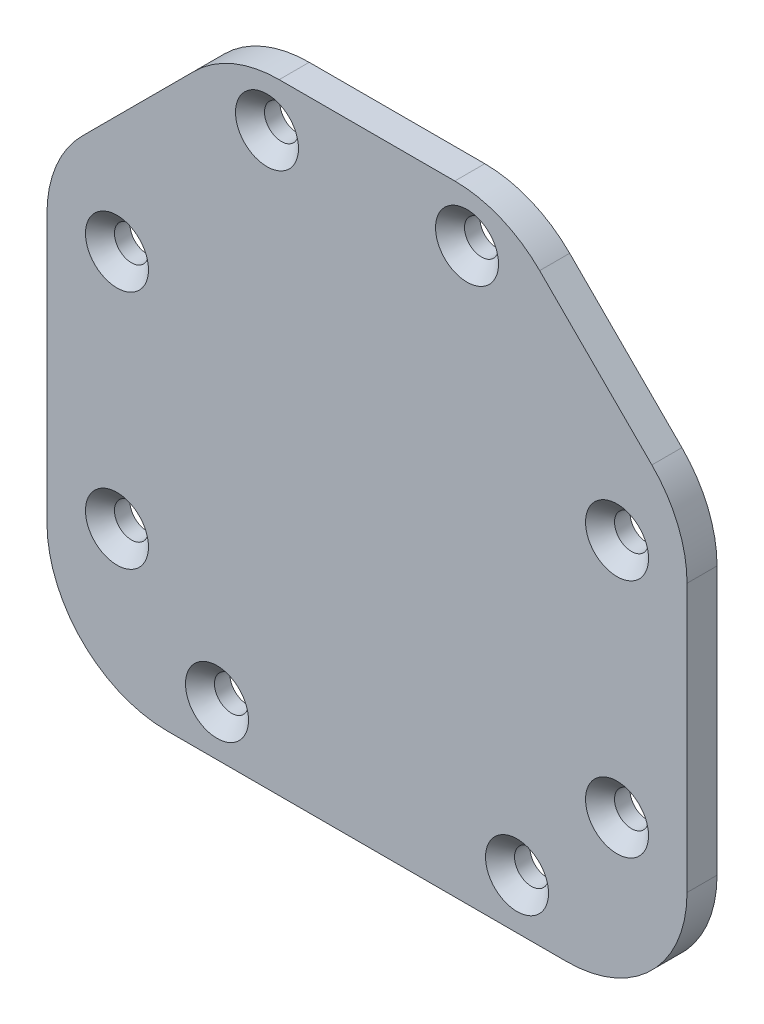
from build123d import *

# Parameters (mm, degrees)
BASE_EXTRUSION_DEPTH                        = 3
FRAISAGE_POUR_VIS_T_TE_FRAIS_E_M31_AT_COUNT = 2
FRAISAGE_POUR_VIS_T_TE_FRAIS_E_M31_AT_PITCH = 20
FRAISAGE_POUR_VIS_T_TE_FRAIS_E_M31_2_COUNT  = 2
FRAISAGE_POUR_VIS_T_TE_FRAIS_E_M31_2_PITCH  = 39.357337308
FRAISAGE_POUR_VIS_T_TE_FRAIS_E_M31_3_COUNT  = 2
FRAISAGE_POUR_VIS_T_TE_FRAIS_E_M31_3_PITCH  = 54.671747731
FRAISAGE_POUR_VIS_T_TE_FRAIS_E_M31_4_COUNT  = 2
FRAISAGE_POUR_VIS_T_TE_FRAIS_E_M31_4_PITCH  = 57.697486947
FRAISAGE_POUR_VIS_T_TE_FRAIS_E_M31_5_COUNT  = 2
FRAISAGE_POUR_VIS_T_TE_FRAIS_E_M31_5_PITCH  = 52.239831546
FRAISAGE_POUR_VIS_T_TE_FRAIS_E_M31_6_COUNT  = 2
FRAISAGE_POUR_VIS_T_TE_FRAIS_E_M31_6_PITCH  = 44.598206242
FRAISAGE_POUR_VIS_T_TE_FRAIS_E_M31_7_COUNT  = 2
FRAISAGE_POUR_VIS_T_TE_FRAIS_E_M31_7_PITCH  = 23.430749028


with BuildPart() as part:
    # Esquisse1 → Base-Extrusion (new body)
    with BuildSketch(Plane.XY):
        with BuildLine():
            Line((-32, 9.779437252), (-32, -17))
            ThreePointArc((-32, -17), (-28.485281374, -25.485281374), (-20, -29))
            Line((-20, -29), (20, -29))
            ThreePointArc((20, -29), (28.485281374, -25.485281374), (32, -17))
            Line((32, -17), (32, 9.779437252))
            ThreePointArc((32, 9.779437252), (31.08655439, 14.37163844), (28.485281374, 18.264718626))
            Line((28.485281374, 18.264718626), (17.264718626, 29.485281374))
            ThreePointArc((17.264718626, 29.485281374), (13.37163844, 32.08655439), (8.779437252, 33))
            Line((8.779437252, 33), (-8.779437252, 33))
            ThreePointArc((-8.779437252, 33), (-13.37163844, 32.08655439), (-17.264718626, 29.485281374))
            Line((-17.264718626, 29.485281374), (-28.485281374, 18.264718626))
            ThreePointArc((-28.485281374, 18.264718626), (-31.08655439, 14.37163844), (-32, 9.779437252))
        make_face()
    extrude(amount=BASE_EXTRUSION_DEPTH)

    # Esquisse6 → Fraisage pour vis _ t_te frais_e M31 (revolve, cut)
    with BuildSketch(Plane(origin=(10, 28, 3), x_dir=(0, -1, 0), z_dir=(1, 0, 0))):
        Polygon((0, 0), (0, 3), (1.7, 3), (1.7, 1.45), (3.15, 0), align=None)
    fraisage_pour_vis_t_te_frais_e_m31 = revolve(axis=Axis((10, 28, 9.35), (0, 0, -1)), mode=Mode.SUBTRACT)

    # Fraisage pour vis _ t_te frais_e M31 at: Fraisage pour vis _ t_te frais_e M31 ×2
    with Locations(*[(-i * FRAISAGE_POUR_VIS_T_TE_FRAIS_E_M31_AT_PITCH, 0, 0) for i in range(1, FRAISAGE_POUR_VIS_T_TE_FRAIS_E_M31_AT_COUNT)]):
        add(fraisage_pour_vis_t_te_frais_e_m31, mode=Mode.SUBTRACT)

    # Fraisage pour vis _ t_te frais_e M31 2: Fraisage pour vis _ t_te frais_e M31 ×2
    with Locations(*[Vector(-0.8892878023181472, -0.4573480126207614, 0) * (i * FRAISAGE_POUR_VIS_T_TE_FRAIS_E_M31_2_PITCH) for i in range(1, FRAISAGE_POUR_VIS_T_TE_FRAIS_E_M31_2_COUNT)]):
        add(fraisage_pour_vis_t_te_frais_e_m31, mode=Mode.SUBTRACT)

    # Fraisage pour vis _ t_te frais_e M31 3: Fraisage pour vis _ t_te frais_e M31 ×2
    with Locations(*[Vector(-0.6401843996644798, -0.7682212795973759, 0) * (i * FRAISAGE_POUR_VIS_T_TE_FRAIS_E_M31_3_PITCH) for i in range(1, FRAISAGE_POUR_VIS_T_TE_FRAIS_E_M31_3_COUNT)]):
        add(fraisage_pour_vis_t_te_frais_e_m31, mode=Mode.SUBTRACT)

    # Fraisage pour vis _ t_te frais_e M31 4: Fraisage pour vis _ t_te frais_e M31 ×2
    with Locations(*[Vector(-0.4332944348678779, -0.9012524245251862, 0) * (i * FRAISAGE_POUR_VIS_T_TE_FRAIS_E_M31_4_PITCH) for i in range(1, FRAISAGE_POUR_VIS_T_TE_FRAIS_E_M31_4_COUNT)]):
        add(fraisage_pour_vis_t_te_frais_e_m31, mode=Mode.SUBTRACT)

    # Fraisage pour vis _ t_te frais_e M31 5: Fraisage pour vis _ t_te frais_e M31 ×2
    with Locations(*[Vector(0.09571240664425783, -0.9954090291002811, 0) * (i * FRAISAGE_POUR_VIS_T_TE_FRAIS_E_M31_5_PITCH) for i in range(1, FRAISAGE_POUR_VIS_T_TE_FRAIS_E_M31_5_COUNT)]):
        add(fraisage_pour_vis_t_te_frais_e_m31, mode=Mode.SUBTRACT)

    # Fraisage pour vis _ t_te frais_e M31 6: Fraisage pour vis _ t_te frais_e M31 ×2
    with Locations(*[Vector(0.33633639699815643, -0.9417419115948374, 0) * (i * FRAISAGE_POUR_VIS_T_TE_FRAIS_E_M31_6_PITCH) for i in range(1, FRAISAGE_POUR_VIS_T_TE_FRAIS_E_M31_6_COUNT)]):
        add(fraisage_pour_vis_t_te_frais_e_m31, mode=Mode.SUBTRACT)

    # Fraisage pour vis _ t_te frais_e M31 7: Fraisage pour vis _ t_te frais_e M31 ×2
    with Locations(*[Vector(0.6401843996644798, -0.7682212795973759, 0) * (i * FRAISAGE_POUR_VIS_T_TE_FRAIS_E_M31_7_PITCH) for i in range(1, FRAISAGE_POUR_VIS_T_TE_FRAIS_E_M31_7_COUNT)]):
        add(fraisage_pour_vis_t_te_frais_e_m31, mode=Mode.SUBTRACT)


solid = part.part
